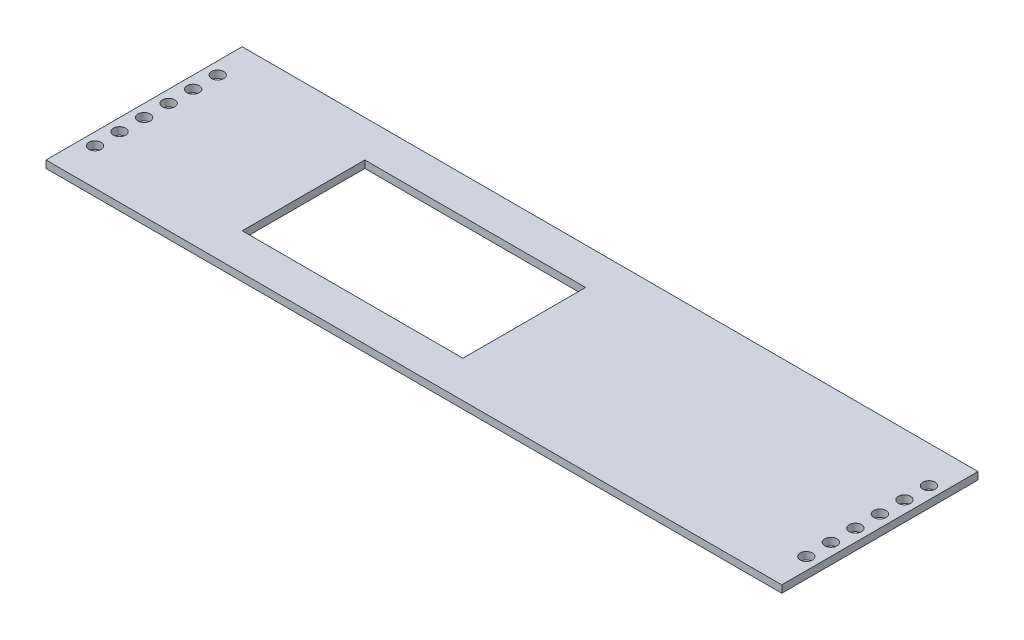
ISO-10303-21;
HEADER;
FILE_DESCRIPTION(('STEP AP214'),'2;1');
FILE_NAME('part.step','',(''),(''),'','','');
FILE_SCHEMA(('AUTOMOTIVE_DESIGN { 1 0 10303 214 1 1 1 1 }'));
ENDSEC;
DATA;
#1=APPLICATION_CONTEXT('core data for automotive mechanical design processes');
#2=APPLICATION_PROTOCOL_DEFINITION('international standard','automotive_design',2000,#1);
#3=PRODUCT_CONTEXT('',#1,'mechanical');
#4=PRODUCT('Part','Part','',(#3));
#5=PRODUCT_RELATED_PRODUCT_CATEGORY('part','',(#4));
#6=PRODUCT_DEFINITION_FORMATION('','',#4);
#7=PRODUCT_DEFINITION_CONTEXT('part definition',#1,'design');
#8=PRODUCT_DEFINITION('design','',#6,#7);
#9=PRODUCT_DEFINITION_SHAPE('','',#8);
#10=(LENGTH_UNIT() NAMED_UNIT(*) SI_UNIT(.MILLI.,.METRE.));
#11=(NAMED_UNIT(*) PLANE_ANGLE_UNIT() SI_UNIT($,.RADIAN.));
#12=(NAMED_UNIT(*) SI_UNIT($,.STERADIAN.) SOLID_ANGLE_UNIT());
#13=UNCERTAINTY_MEASURE_WITH_UNIT(LENGTH_MEASURE(1.E-05),#10,'distance_accuracy_value','');
#14=(GEOMETRIC_REPRESENTATION_CONTEXT(3) GLOBAL_UNCERTAINTY_ASSIGNED_CONTEXT((#13)) GLOBAL_UNIT_ASSIGNED_CONTEXT((#10,
#11,#12)) REPRESENTATION_CONTEXT('',''));
#15=CARTESIAN_POINT('',(0.,0.,0.));
#16=DIRECTION('',(0.,0.,1.));
#17=DIRECTION('',(1.,0.,0.));
#18=AXIS2_PLACEMENT_3D('',#15,#16,#17);
#19=CARTESIAN_POINT('',(300.,6.,80.));
#20=DIRECTION('',(-1.,0.,0.));
#21=DIRECTION('',(0.,0.,1.));
#22=AXIS2_PLACEMENT_3D('',#19,#20,#21);
#23=PLANE('',#22);
#24=DIRECTION('',(0.,0.,-1.));
#25=VECTOR('',#24,1.);
#26=CARTESIAN_POINT('',(300.,0.,80.));
#27=LINE('',#26,#25);
#28=CARTESIAN_POINT('',(300.,0.,80.));
#29=VERTEX_POINT('',#28);
#30=CARTESIAN_POINT('',(300.,0.,-80.));
#31=VERTEX_POINT('',#30);
#32=EDGE_CURVE('E194',#29,#31,#27,.T.);
#33=ORIENTED_EDGE('',*,*,#32,.T.);
#34=DIRECTION('',(0.,-1.,0.));
#35=VECTOR('',#34,1.);
#36=CARTESIAN_POINT('',(300.,6.,-80.));
#37=LINE('',#36,#35);
#38=CARTESIAN_POINT('',(300.,6.,-80.));
#39=VERTEX_POINT('',#38);
#40=EDGE_CURVE('E223',#39,#31,#37,.T.);
#41=ORIENTED_EDGE('',*,*,#40,.F.);
#42=DIRECTION('',(0.,0.,-1.));
#43=VECTOR('',#42,1.);
#44=CARTESIAN_POINT('',(300.,6.,80.));
#45=LINE('',#44,#43);
#46=CARTESIAN_POINT('',(300.,6.,80.));
#47=VERTEX_POINT('',#46);
#48=EDGE_CURVE('E197',#47,#39,#45,.T.);
#49=ORIENTED_EDGE('',*,*,#48,.F.);
#50=DIRECTION('',(0.,-1.,0.));
#51=VECTOR('',#50,1.);
#52=CARTESIAN_POINT('',(300.,6.,80.));
#53=LINE('',#52,#51);
#54=EDGE_CURVE('E207',#47,#29,#53,.T.);
#55=ORIENTED_EDGE('',*,*,#54,.T.);
#56=EDGE_LOOP('',(#33,#41,#49,#55));
#57=FACE_BOUND('',#56,.T.);
#58=ADVANCED_FACE('F33',(#57),#23,.F.);
#59=CARTESIAN_POINT('',(-300.,6.,-80.));
#60=DIRECTION('',(0.,0.,1.));
#61=DIRECTION('',(1.,0.,0.));
#62=AXIS2_PLACEMENT_3D('',#59,#60,#61);
#63=PLANE('',#62);
#64=DIRECTION('',(-1.,0.,0.));
#65=VECTOR('',#64,1.);
#66=CARTESIAN_POINT('',(-300.,0.,-80.));
#67=LINE('',#66,#65);
#68=CARTESIAN_POINT('',(-300.,0.,-80.));
#69=VERTEX_POINT('',#68);
#70=EDGE_CURVE('E210',#31,#69,#67,.T.);
#71=ORIENTED_EDGE('',*,*,#70,.T.);
#72=DIRECTION('',(0.,-1.,0.));
#73=VECTOR('',#72,1.);
#74=CARTESIAN_POINT('',(-300.,6.,-80.));
#75=LINE('',#74,#73);
#76=CARTESIAN_POINT('',(-300.,6.,-80.));
#77=VERTEX_POINT('',#76);
#78=EDGE_CURVE('E220',#77,#69,#75,.T.);
#79=ORIENTED_EDGE('',*,*,#78,.F.);
#80=DIRECTION('',(-1.,0.,0.));
#81=VECTOR('',#80,1.);
#82=CARTESIAN_POINT('',(-300.,6.,-80.));
#83=LINE('',#82,#81);
#84=EDGE_CURVE('E200',#39,#77,#83,.T.);
#85=ORIENTED_EDGE('',*,*,#84,.F.);
#86=ORIENTED_EDGE('',*,*,#40,.T.);
#87=EDGE_LOOP('',(#71,#79,#85,#86));
#88=FACE_BOUND('',#87,.T.);
#89=ADVANCED_FACE('F250',(#88),#63,.F.);
#90=CARTESIAN_POINT('',(-300.,6.,80.));
#91=DIRECTION('',(1.,0.,0.));
#92=DIRECTION('',(0.,0.,-1.));
#93=AXIS2_PLACEMENT_3D('',#90,#91,#92);
#94=PLANE('',#93);
#95=DIRECTION('',(0.,0.,1.));
#96=VECTOR('',#95,1.);
#97=CARTESIAN_POINT('',(-300.,0.,80.));
#98=LINE('',#97,#96);
#99=CARTESIAN_POINT('',(-300.,0.,80.));
#100=VERTEX_POINT('',#99);
#101=EDGE_CURVE('E212',#69,#100,#98,.T.);
#102=ORIENTED_EDGE('',*,*,#101,.T.);
#103=DIRECTION('',(0.,-1.,0.));
#104=VECTOR('',#103,1.);
#105=CARTESIAN_POINT('',(-300.,6.,80.));
#106=LINE('',#105,#104);
#107=CARTESIAN_POINT('',(-300.,6.,80.));
#108=VERTEX_POINT('',#107);
#109=EDGE_CURVE('E217',#108,#100,#106,.T.);
#110=ORIENTED_EDGE('',*,*,#109,.F.);
#111=DIRECTION('',(0.,0.,1.));
#112=VECTOR('',#111,1.);
#113=CARTESIAN_POINT('',(-300.,6.,80.));
#114=LINE('',#113,#112);
#115=EDGE_CURVE('E203',#77,#108,#114,.T.);
#116=ORIENTED_EDGE('',*,*,#115,.F.);
#117=ORIENTED_EDGE('',*,*,#78,.T.);
#118=EDGE_LOOP('',(#102,#110,#116,#117));
#119=FACE_BOUND('',#118,.T.);
#120=ADVANCED_FACE('F255',(#119),#94,.F.);
#121=CARTESIAN_POINT('',(-300.,6.,80.));
#122=DIRECTION('',(0.,0.,-1.));
#123=DIRECTION('',(-1.,0.,0.));
#124=AXIS2_PLACEMENT_3D('',#121,#122,#123);
#125=PLANE('',#124);
#126=DIRECTION('',(1.,0.,0.));
#127=VECTOR('',#126,1.);
#128=CARTESIAN_POINT('',(-300.,0.,80.));
#129=LINE('',#128,#127);
#130=EDGE_CURVE('E201',#100,#29,#129,.T.);
#131=ORIENTED_EDGE('',*,*,#130,.T.);
#132=ORIENTED_EDGE('',*,*,#54,.F.);
#133=DIRECTION('',(1.,0.,0.));
#134=VECTOR('',#133,1.);
#135=CARTESIAN_POINT('',(-300.,6.,80.));
#136=LINE('',#135,#134);
#137=EDGE_CURVE('E205',#108,#47,#136,.T.);
#138=ORIENTED_EDGE('',*,*,#137,.F.);
#139=ORIENTED_EDGE('',*,*,#109,.T.);
#140=EDGE_LOOP('',(#131,#132,#138,#139));
#141=FACE_BOUND('',#140,.T.);
#142=ADVANCED_FACE('F270',(#141),#125,.F.);
#143=CARTESIAN_POINT('',(0.,6.,0.));
#144=DIRECTION('',(0.,-1.,0.));
#145=DIRECTION('',(0.,0.,-1.));
#146=AXIS2_PLACEMENT_3D('',#143,#144,#145);
#147=PLANE('',#146);
#148=DIRECTION('',(-1.,0.,0.));
#149=VECTOR('',#148,1.);
#150=CARTESIAN_POINT('',(-170.,6.,-50.));
#151=LINE('',#150,#149);
#152=CARTESIAN_POINT('',(9.99999999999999,6.,-50.));
#153=VERTEX_POINT('',#152);
#154=CARTESIAN_POINT('',(-170.,6.,-50.));
#155=VERTEX_POINT('',#154);
#156=EDGE_CURVE('E108',#153,#155,#151,.T.);
#157=ORIENTED_EDGE('',*,*,#156,.F.);
#158=DIRECTION('',(0.,0.,-1.));
#159=VECTOR('',#158,1.);
#160=CARTESIAN_POINT('',(9.99999999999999,6.,50.));
#161=LINE('',#160,#159);
#162=CARTESIAN_POINT('',(9.99999999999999,6.,50.));
#163=VERTEX_POINT('',#162);
#164=EDGE_CURVE('E47',#163,#153,#161,.T.);
#165=ORIENTED_EDGE('',*,*,#164,.F.);
#166=DIRECTION('',(1.,0.,0.));
#167=VECTOR('',#166,1.);
#168=CARTESIAN_POINT('',(-170.,6.,50.));
#169=LINE('',#168,#167);
#170=CARTESIAN_POINT('',(-170.,6.,50.));
#171=VERTEX_POINT('',#170);
#172=EDGE_CURVE('E115',#171,#163,#169,.T.);
#173=ORIENTED_EDGE('',*,*,#172,.F.);
#174=DIRECTION('',(0.,0.,1.));
#175=VECTOR('',#174,1.);
#176=CARTESIAN_POINT('',(-170.,6.,50.));
#177=LINE('',#176,#175);
#178=EDGE_CURVE('E99',#155,#171,#177,.T.);
#179=ORIENTED_EDGE('',*,*,#178,.F.);
#180=EDGE_LOOP('',(#157,#165,#173,#179));
#181=FACE_BOUND('',#180,.T.);
#182=CARTESIAN_POINT('',(290.,6.,30.));
#183=DIRECTION('',(0.,-1.,0.));
#184=DIRECTION('',(0.,0.,1.));
#185=AXIS2_PLACEMENT_3D('',#182,#183,#184);
#186=CIRCLE('',#185,4.99999999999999);
#187=CARTESIAN_POINT('',(290.,6.,35.));
#188=VERTEX_POINT('',#187);
#189=EDGE_CURVE('E129',#188,#188,#186,.T.);
#190=ORIENTED_EDGE('',*,*,#189,.T.);
#191=EDGE_LOOP('',(#190));
#192=FACE_BOUND('',#191,.T.);
#193=CARTESIAN_POINT('',(290.,6.,10.));
#194=DIRECTION('',(0.,-1.,0.));
#195=DIRECTION('',(0.,0.,1.));
#196=AXIS2_PLACEMENT_3D('',#193,#194,#195);
#197=CIRCLE('',#196,4.99999999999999);
#198=CARTESIAN_POINT('',(290.,6.,15.));
#199=VERTEX_POINT('',#198);
#200=EDGE_CURVE('E135',#199,#199,#197,.T.);
#201=ORIENTED_EDGE('',*,*,#200,.T.);
#202=EDGE_LOOP('',(#201));
#203=FACE_BOUND('',#202,.T.);
#204=CARTESIAN_POINT('',(290.,6.,-9.99999999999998));
#205=DIRECTION('',(0.,-1.,0.));
#206=DIRECTION('',(0.,0.,1.));
#207=AXIS2_PLACEMENT_3D('',#204,#205,#206);
#208=CIRCLE('',#207,4.99999999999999);
#209=CARTESIAN_POINT('',(290.,6.,-4.99999999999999));
#210=VERTEX_POINT('',#209);
#211=EDGE_CURVE('E122',#210,#210,#208,.T.);
#212=ORIENTED_EDGE('',*,*,#211,.T.);
#213=EDGE_LOOP('',(#212));
#214=FACE_BOUND('',#213,.T.);
#215=CARTESIAN_POINT('',(290.,6.,-50.));
#216=DIRECTION('',(0.,-1.,0.));
#217=DIRECTION('',(0.,0.,1.));
#218=AXIS2_PLACEMENT_3D('',#215,#216,#217);
#219=CIRCLE('',#218,4.99999999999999);
#220=CARTESIAN_POINT('',(290.,6.,-45.));
#221=VERTEX_POINT('',#220);
#222=EDGE_CURVE('E143',#221,#221,#219,.T.);
#223=ORIENTED_EDGE('',*,*,#222,.T.);
#224=EDGE_LOOP('',(#223));
#225=FACE_BOUND('',#224,.T.);
#226=CARTESIAN_POINT('',(290.,6.,-30.));
#227=DIRECTION('',(0.,-1.,0.));
#228=DIRECTION('',(0.,0.,1.));
#229=AXIS2_PLACEMENT_3D('',#226,#227,#228);
#230=CIRCLE('',#229,4.99999999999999);
#231=CARTESIAN_POINT('',(290.,6.,-25.));
#232=VERTEX_POINT('',#231);
#233=EDGE_CURVE('E142',#232,#232,#230,.T.);
#234=ORIENTED_EDGE('',*,*,#233,.T.);
#235=EDGE_LOOP('',(#234));
#236=FACE_BOUND('',#235,.T.);
#237=CARTESIAN_POINT('',(290.,6.,50.));
#238=DIRECTION('',(0.,-1.,0.));
#239=DIRECTION('',(0.,0.,1.));
#240=AXIS2_PLACEMENT_3D('',#237,#238,#239);
#241=CIRCLE('',#240,4.99999999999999);
#242=CARTESIAN_POINT('',(290.,6.,55.));
#243=VERTEX_POINT('',#242);
#244=EDGE_CURVE('E128',#243,#243,#241,.T.);
#245=ORIENTED_EDGE('',*,*,#244,.T.);
#246=EDGE_LOOP('',(#245));
#247=FACE_BOUND('',#246,.T.);
#248=CARTESIAN_POINT('',(-290.,6.,30.));
#249=DIRECTION('',(0.,1.,0.));
#250=DIRECTION('',(0.,0.,1.));
#251=AXIS2_PLACEMENT_3D('',#248,#249,#250);
#252=CIRCLE('',#251,4.99999999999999);
#253=CARTESIAN_POINT('',(-290.,6.,35.));
#254=VERTEX_POINT('',#253);
#255=EDGE_CURVE('E165',#254,#254,#252,.T.);
#256=ORIENTED_EDGE('',*,*,#255,.F.);
#257=EDGE_LOOP('',(#256));
#258=FACE_BOUND('',#257,.T.);
#259=CARTESIAN_POINT('',(-290.,6.,10.));
#260=DIRECTION('',(0.,1.,0.));
#261=DIRECTION('',(0.,0.,1.));
#262=AXIS2_PLACEMENT_3D('',#259,#260,#261);
#263=CIRCLE('',#262,4.99999999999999);
#264=CARTESIAN_POINT('',(-290.,6.,15.));
#265=VERTEX_POINT('',#264);
#266=EDGE_CURVE('E171',#265,#265,#263,.T.);
#267=ORIENTED_EDGE('',*,*,#266,.F.);
#268=EDGE_LOOP('',(#267));
#269=FACE_BOUND('',#268,.T.);
#270=CARTESIAN_POINT('',(-290.,6.,-9.99999999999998));
#271=DIRECTION('',(0.,1.,0.));
#272=DIRECTION('',(0.,0.,1.));
#273=AXIS2_PLACEMENT_3D('',#270,#271,#272);
#274=CIRCLE('',#273,4.99999999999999);
#275=CARTESIAN_POINT('',(-290.,6.,-4.99999999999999));
#276=VERTEX_POINT('',#275);
#277=EDGE_CURVE('E158',#276,#276,#274,.T.);
#278=ORIENTED_EDGE('',*,*,#277,.F.);
#279=EDGE_LOOP('',(#278));
#280=FACE_BOUND('',#279,.T.);
#281=CARTESIAN_POINT('',(-290.,6.,-50.));
#282=DIRECTION('',(0.,1.,0.));
#283=DIRECTION('',(0.,0.,1.));
#284=AXIS2_PLACEMENT_3D('',#281,#282,#283);
#285=CIRCLE('',#284,4.99999999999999);
#286=CARTESIAN_POINT('',(-290.,6.,-45.));
#287=VERTEX_POINT('',#286);
#288=EDGE_CURVE('E179',#287,#287,#285,.T.);
#289=ORIENTED_EDGE('',*,*,#288,.F.);
#290=EDGE_LOOP('',(#289));
#291=FACE_BOUND('',#290,.T.);
#292=CARTESIAN_POINT('',(-290.,6.,-30.));
#293=DIRECTION('',(0.,1.,0.));
#294=DIRECTION('',(0.,0.,1.));
#295=AXIS2_PLACEMENT_3D('',#292,#293,#294);
#296=CIRCLE('',#295,4.99999999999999);
#297=CARTESIAN_POINT('',(-290.,6.,-25.));
#298=VERTEX_POINT('',#297);
#299=EDGE_CURVE('E178',#298,#298,#296,.T.);
#300=ORIENTED_EDGE('',*,*,#299,.F.);
#301=EDGE_LOOP('',(#300));
#302=FACE_BOUND('',#301,.T.);
#303=CARTESIAN_POINT('',(-290.,6.,50.));
#304=DIRECTION('',(0.,1.,0.));
#305=DIRECTION('',(0.,0.,1.));
#306=AXIS2_PLACEMENT_3D('',#303,#304,#305);
#307=CIRCLE('',#306,4.99999999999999);
#308=CARTESIAN_POINT('',(-290.,6.,55.));
#309=VERTEX_POINT('',#308);
#310=EDGE_CURVE('E164',#309,#309,#307,.T.);
#311=ORIENTED_EDGE('',*,*,#310,.F.);
#312=EDGE_LOOP('',(#311));
#313=FACE_BOUND('',#312,.T.);
#314=ORIENTED_EDGE('',*,*,#48,.T.);
#315=ORIENTED_EDGE('',*,*,#84,.T.);
#316=ORIENTED_EDGE('',*,*,#115,.T.);
#317=ORIENTED_EDGE('',*,*,#137,.T.);
#318=EDGE_LOOP('',(#314,#315,#316,#317));
#319=FACE_BOUND('',#318,.T.);
#320=ADVANCED_FACE('F112',(#181,#192,#203,#214,#225,#236,#247,#258,#269,#280,#291,#302,#313,
#319),#147,.F.);
#321=CARTESIAN_POINT('',(0.,0.,0.));
#322=DIRECTION('',(0.,-1.,0.));
#323=DIRECTION('',(0.,0.,-1.));
#324=AXIS2_PLACEMENT_3D('',#321,#322,#323);
#325=PLANE('',#324);
#326=DIRECTION('',(0.,0.,1.));
#327=VECTOR('',#326,1.);
#328=CARTESIAN_POINT('',(9.99999999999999,0.,0.));
#329=LINE('',#328,#327);
#330=CARTESIAN_POINT('',(9.99999999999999,0.,-50.));
#331=VERTEX_POINT('',#330);
#332=CARTESIAN_POINT('',(9.99999999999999,0.,50.));
#333=VERTEX_POINT('',#332);
#334=EDGE_CURVE('E11',#331,#333,#329,.T.);
#335=ORIENTED_EDGE('',*,*,#334,.F.);
#336=DIRECTION('',(1.,0.,0.));
#337=VECTOR('',#336,1.);
#338=CARTESIAN_POINT('',(0.,0.,-50.));
#339=LINE('',#338,#337);
#340=CARTESIAN_POINT('',(-170.,0.,-50.));
#341=VERTEX_POINT('',#340);
#342=EDGE_CURVE('E226',#341,#331,#339,.T.);
#343=ORIENTED_EDGE('',*,*,#342,.F.);
#344=DIRECTION('',(0.,0.,-1.));
#345=VECTOR('',#344,1.);
#346=CARTESIAN_POINT('',(-170.,0.,0.));
#347=LINE('',#346,#345);
#348=CARTESIAN_POINT('',(-170.,0.,50.));
#349=VERTEX_POINT('',#348);
#350=EDGE_CURVE('E102',#349,#341,#347,.T.);
#351=ORIENTED_EDGE('',*,*,#350,.F.);
#352=DIRECTION('',(-1.,0.,0.));
#353=VECTOR('',#352,1.);
#354=CARTESIAN_POINT('',(0.,0.,50.));
#355=LINE('',#354,#353);
#356=EDGE_CURVE('E40',#333,#349,#355,.T.);
#357=ORIENTED_EDGE('',*,*,#356,.F.);
#358=EDGE_LOOP('',(#335,#343,#351,#357));
#359=FACE_BOUND('',#358,.T.);
#360=CARTESIAN_POINT('',(290.,0.,30.));
#361=DIRECTION('',(0.,-1.,0.));
#362=DIRECTION('',(0.,0.,1.));
#363=AXIS2_PLACEMENT_3D('',#360,#361,#362);
#364=CIRCLE('',#363,4.99999999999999);
#365=CARTESIAN_POINT('',(290.,0.,35.));
#366=VERTEX_POINT('',#365);
#367=EDGE_CURVE('E125',#366,#366,#364,.T.);
#368=ORIENTED_EDGE('',*,*,#367,.F.);
#369=EDGE_LOOP('',(#368));
#370=FACE_BOUND('',#369,.T.);
#371=CARTESIAN_POINT('',(290.,0.,10.));
#372=DIRECTION('',(0.,-1.,0.));
#373=DIRECTION('',(0.,0.,1.));
#374=AXIS2_PLACEMENT_3D('',#371,#372,#373);
#375=CIRCLE('',#374,4.99999999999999);
#376=CARTESIAN_POINT('',(290.,0.,15.));
#377=VERTEX_POINT('',#376);
#378=EDGE_CURVE('E132',#377,#377,#375,.T.);
#379=ORIENTED_EDGE('',*,*,#378,.F.);
#380=EDGE_LOOP('',(#379));
#381=FACE_BOUND('',#380,.T.);
#382=CARTESIAN_POINT('',(290.,0.,-9.99999999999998));
#383=DIRECTION('',(0.,-1.,0.));
#384=DIRECTION('',(0.,0.,1.));
#385=AXIS2_PLACEMENT_3D('',#382,#383,#384);
#386=CIRCLE('',#385,4.99999999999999);
#387=CARTESIAN_POINT('',(290.,0.,-4.99999999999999));
#388=VERTEX_POINT('',#387);
#389=EDGE_CURVE('E146',#388,#388,#386,.T.);
#390=ORIENTED_EDGE('',*,*,#389,.F.);
#391=EDGE_LOOP('',(#390));
#392=FACE_BOUND('',#391,.T.);
#393=CARTESIAN_POINT('',(290.,0.,-50.));
#394=DIRECTION('',(0.,-1.,0.));
#395=DIRECTION('',(0.,0.,1.));
#396=AXIS2_PLACEMENT_3D('',#393,#394,#395);
#397=CIRCLE('',#396,4.99999999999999);
#398=CARTESIAN_POINT('',(290.,0.,-45.));
#399=VERTEX_POINT('',#398);
#400=EDGE_CURVE('E139',#399,#399,#397,.T.);
#401=ORIENTED_EDGE('',*,*,#400,.F.);
#402=EDGE_LOOP('',(#401));
#403=FACE_BOUND('',#402,.T.);
#404=CARTESIAN_POINT('',(290.,0.,-30.));
#405=DIRECTION('',(0.,-1.,0.));
#406=DIRECTION('',(0.,0.,1.));
#407=AXIS2_PLACEMENT_3D('',#404,#405,#406);
#408=CIRCLE('',#407,4.99999999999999);
#409=CARTESIAN_POINT('',(290.,0.,-25.));
#410=VERTEX_POINT('',#409);
#411=EDGE_CURVE('E138',#410,#410,#408,.T.);
#412=ORIENTED_EDGE('',*,*,#411,.F.);
#413=EDGE_LOOP('',(#412));
#414=FACE_BOUND('',#413,.T.);
#415=CARTESIAN_POINT('',(290.,0.,50.));
#416=DIRECTION('',(0.,-1.,0.));
#417=DIRECTION('',(0.,0.,1.));
#418=AXIS2_PLACEMENT_3D('',#415,#416,#417);
#419=CIRCLE('',#418,4.99999999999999);
#420=CARTESIAN_POINT('',(290.,0.,55.));
#421=VERTEX_POINT('',#420);
#422=EDGE_CURVE('E155',#421,#421,#419,.T.);
#423=ORIENTED_EDGE('',*,*,#422,.F.);
#424=EDGE_LOOP('',(#423));
#425=FACE_BOUND('',#424,.T.);
#426=CARTESIAN_POINT('',(-290.,0.,30.));
#427=DIRECTION('',(0.,1.,0.));
#428=DIRECTION('',(0.,0.,1.));
#429=AXIS2_PLACEMENT_3D('',#426,#427,#428);
#430=CIRCLE('',#429,4.99999999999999);
#431=CARTESIAN_POINT('',(-290.,0.,35.));
#432=VERTEX_POINT('',#431);
#433=EDGE_CURVE('E161',#432,#432,#430,.T.);
#434=ORIENTED_EDGE('',*,*,#433,.T.);
#435=EDGE_LOOP('',(#434));
#436=FACE_BOUND('',#435,.T.);
#437=CARTESIAN_POINT('',(-290.,0.,10.));
#438=DIRECTION('',(0.,1.,0.));
#439=DIRECTION('',(0.,0.,1.));
#440=AXIS2_PLACEMENT_3D('',#437,#438,#439);
#441=CIRCLE('',#440,4.99999999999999);
#442=CARTESIAN_POINT('',(-290.,0.,15.));
#443=VERTEX_POINT('',#442);
#444=EDGE_CURVE('E168',#443,#443,#441,.T.);
#445=ORIENTED_EDGE('',*,*,#444,.T.);
#446=EDGE_LOOP('',(#445));
#447=FACE_BOUND('',#446,.T.);
#448=CARTESIAN_POINT('',(-290.,0.,-9.99999999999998));
#449=DIRECTION('',(0.,1.,0.));
#450=DIRECTION('',(0.,0.,1.));
#451=AXIS2_PLACEMENT_3D('',#448,#449,#450);
#452=CIRCLE('',#451,4.99999999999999);
#453=CARTESIAN_POINT('',(-290.,0.,-4.99999999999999));
#454=VERTEX_POINT('',#453);
#455=EDGE_CURVE('E182',#454,#454,#452,.T.);
#456=ORIENTED_EDGE('',*,*,#455,.T.);
#457=EDGE_LOOP('',(#456));
#458=FACE_BOUND('',#457,.T.);
#459=CARTESIAN_POINT('',(-290.,0.,-50.));
#460=DIRECTION('',(0.,1.,0.));
#461=DIRECTION('',(0.,0.,1.));
#462=AXIS2_PLACEMENT_3D('',#459,#460,#461);
#463=CIRCLE('',#462,4.99999999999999);
#464=CARTESIAN_POINT('',(-290.,0.,-45.));
#465=VERTEX_POINT('',#464);
#466=EDGE_CURVE('E175',#465,#465,#463,.T.);
#467=ORIENTED_EDGE('',*,*,#466,.T.);
#468=EDGE_LOOP('',(#467));
#469=FACE_BOUND('',#468,.T.);
#470=CARTESIAN_POINT('',(-290.,0.,-30.));
#471=DIRECTION('',(0.,1.,0.));
#472=DIRECTION('',(0.,0.,1.));
#473=AXIS2_PLACEMENT_3D('',#470,#471,#472);
#474=CIRCLE('',#473,4.99999999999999);
#475=CARTESIAN_POINT('',(-290.,0.,-25.));
#476=VERTEX_POINT('',#475);
#477=EDGE_CURVE('E174',#476,#476,#474,.T.);
#478=ORIENTED_EDGE('',*,*,#477,.T.);
#479=EDGE_LOOP('',(#478));
#480=FACE_BOUND('',#479,.T.);
#481=CARTESIAN_POINT('',(-290.,0.,50.));
#482=DIRECTION('',(0.,1.,0.));
#483=DIRECTION('',(0.,0.,1.));
#484=AXIS2_PLACEMENT_3D('',#481,#482,#483);
#485=CIRCLE('',#484,4.99999999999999);
#486=CARTESIAN_POINT('',(-290.,0.,55.));
#487=VERTEX_POINT('',#486);
#488=EDGE_CURVE('E191',#487,#487,#485,.T.);
#489=ORIENTED_EDGE('',*,*,#488,.T.);
#490=EDGE_LOOP('',(#489));
#491=FACE_BOUND('',#490,.T.);
#492=ORIENTED_EDGE('',*,*,#32,.F.);
#493=ORIENTED_EDGE('',*,*,#130,.F.);
#494=ORIENTED_EDGE('',*,*,#101,.F.);
#495=ORIENTED_EDGE('',*,*,#70,.F.);
#496=EDGE_LOOP('',(#492,#493,#494,#495));
#497=FACE_BOUND('',#496,.T.);
#498=ADVANCED_FACE('F234',(#359,#370,#381,#392,#403,#414,#425,#436,#447,#458,#469,#480,#491,
#497),#325,.T.);
#499=CARTESIAN_POINT('',(-290.,0.,50.));
#500=DIRECTION('',(0.,1.,0.));
#501=DIRECTION('',(0.,0.,1.));
#502=AXIS2_PLACEMENT_3D('',#499,#500,#501);
#503=CYLINDRICAL_SURFACE('',#502,4.99999999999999);
#504=ORIENTED_EDGE('',*,*,#488,.F.);
#505=EDGE_LOOP('',(#504));
#506=FACE_BOUND('',#505,.T.);
#507=ORIENTED_EDGE('',*,*,#310,.T.);
#508=EDGE_LOOP('',(#507));
#509=FACE_BOUND('',#508,.T.);
#510=ADVANCED_FACE('F281',(#506,#509),#503,.F.);
#511=CARTESIAN_POINT('',(-290.,0.,-30.));
#512=DIRECTION('',(0.,1.,0.));
#513=DIRECTION('',(0.,0.,1.));
#514=AXIS2_PLACEMENT_3D('',#511,#512,#513);
#515=CYLINDRICAL_SURFACE('',#514,4.99999999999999);
#516=ORIENTED_EDGE('',*,*,#477,.F.);
#517=EDGE_LOOP('',(#516));
#518=FACE_BOUND('',#517,.T.);
#519=ORIENTED_EDGE('',*,*,#299,.T.);
#520=EDGE_LOOP('',(#519));
#521=FACE_BOUND('',#520,.T.);
#522=ADVANCED_FACE('F286',(#518,#521),#515,.F.);
#523=CARTESIAN_POINT('',(-290.,0.,-50.));
#524=DIRECTION('',(0.,1.,0.));
#525=DIRECTION('',(0.,0.,1.));
#526=AXIS2_PLACEMENT_3D('',#523,#524,#525);
#527=CYLINDRICAL_SURFACE('',#526,4.99999999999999);
#528=ORIENTED_EDGE('',*,*,#466,.F.);
#529=EDGE_LOOP('',(#528));
#530=FACE_BOUND('',#529,.T.);
#531=ORIENTED_EDGE('',*,*,#288,.T.);
#532=EDGE_LOOP('',(#531));
#533=FACE_BOUND('',#532,.T.);
#534=ADVANCED_FACE('F290',(#530,#533),#527,.F.);
#535=CARTESIAN_POINT('',(-290.,0.,-9.99999999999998));
#536=DIRECTION('',(0.,1.,0.));
#537=DIRECTION('',(0.,0.,1.));
#538=AXIS2_PLACEMENT_3D('',#535,#536,#537);
#539=CYLINDRICAL_SURFACE('',#538,4.99999999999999);
#540=ORIENTED_EDGE('',*,*,#455,.F.);
#541=EDGE_LOOP('',(#540));
#542=FACE_BOUND('',#541,.T.);
#543=ORIENTED_EDGE('',*,*,#277,.T.);
#544=EDGE_LOOP('',(#543));
#545=FACE_BOUND('',#544,.T.);
#546=ADVANCED_FACE('F292',(#542,#545),#539,.F.);
#547=CARTESIAN_POINT('',(-290.,0.,10.));
#548=DIRECTION('',(0.,1.,0.));
#549=DIRECTION('',(0.,0.,1.));
#550=AXIS2_PLACEMENT_3D('',#547,#548,#549);
#551=CYLINDRICAL_SURFACE('',#550,4.99999999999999);
#552=ORIENTED_EDGE('',*,*,#444,.F.);
#553=EDGE_LOOP('',(#552));
#554=FACE_BOUND('',#553,.T.);
#555=ORIENTED_EDGE('',*,*,#266,.T.);
#556=EDGE_LOOP('',(#555));
#557=FACE_BOUND('',#556,.T.);
#558=ADVANCED_FACE('F295',(#554,#557),#551,.F.);
#559=CARTESIAN_POINT('',(-290.,0.,30.));
#560=DIRECTION('',(0.,1.,0.));
#561=DIRECTION('',(0.,0.,1.));
#562=AXIS2_PLACEMENT_3D('',#559,#560,#561);
#563=CYLINDRICAL_SURFACE('',#562,4.99999999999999);
#564=ORIENTED_EDGE('',*,*,#433,.F.);
#565=EDGE_LOOP('',(#564));
#566=FACE_BOUND('',#565,.T.);
#567=ORIENTED_EDGE('',*,*,#255,.T.);
#568=EDGE_LOOP('',(#567));
#569=FACE_BOUND('',#568,.T.);
#570=ADVANCED_FACE('F302',(#566,#569),#563,.F.);
#571=CARTESIAN_POINT('',(290.,0.,50.));
#572=DIRECTION('',(0.,1.,0.));
#573=DIRECTION('',(0.,0.,1.));
#574=AXIS2_PLACEMENT_3D('',#571,#572,#573);
#575=CYLINDRICAL_SURFACE('',#574,4.99999999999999);
#576=ORIENTED_EDGE('',*,*,#422,.T.);
#577=EDGE_LOOP('',(#576));
#578=FACE_BOUND('',#577,.T.);
#579=ORIENTED_EDGE('',*,*,#244,.F.);
#580=EDGE_LOOP('',(#579));
#581=FACE_BOUND('',#580,.T.);
#582=ADVANCED_FACE('F306',(#578,#581),#575,.F.);
#583=CARTESIAN_POINT('',(290.,0.,-30.));
#584=DIRECTION('',(0.,1.,0.));
#585=DIRECTION('',(0.,0.,1.));
#586=AXIS2_PLACEMENT_3D('',#583,#584,#585);
#587=CYLINDRICAL_SURFACE('',#586,4.99999999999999);
#588=ORIENTED_EDGE('',*,*,#411,.T.);
#589=EDGE_LOOP('',(#588));
#590=FACE_BOUND('',#589,.T.);
#591=ORIENTED_EDGE('',*,*,#233,.F.);
#592=EDGE_LOOP('',(#591));
#593=FACE_BOUND('',#592,.T.);
#594=ADVANCED_FACE('F310',(#590,#593),#587,.F.);
#595=CARTESIAN_POINT('',(290.,0.,-50.));
#596=DIRECTION('',(0.,1.,0.));
#597=DIRECTION('',(0.,0.,1.));
#598=AXIS2_PLACEMENT_3D('',#595,#596,#597);
#599=CYLINDRICAL_SURFACE('',#598,4.99999999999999);
#600=ORIENTED_EDGE('',*,*,#400,.T.);
#601=EDGE_LOOP('',(#600));
#602=FACE_BOUND('',#601,.T.);
#603=ORIENTED_EDGE('',*,*,#222,.F.);
#604=EDGE_LOOP('',(#603));
#605=FACE_BOUND('',#604,.T.);
#606=ADVANCED_FACE('F314',(#602,#605),#599,.F.);
#607=CARTESIAN_POINT('',(290.,0.,-9.99999999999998));
#608=DIRECTION('',(0.,1.,0.));
#609=DIRECTION('',(0.,0.,1.));
#610=AXIS2_PLACEMENT_3D('',#607,#608,#609);
#611=CYLINDRICAL_SURFACE('',#610,4.99999999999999);
#612=ORIENTED_EDGE('',*,*,#389,.T.);
#613=EDGE_LOOP('',(#612));
#614=FACE_BOUND('',#613,.T.);
#615=ORIENTED_EDGE('',*,*,#211,.F.);
#616=EDGE_LOOP('',(#615));
#617=FACE_BOUND('',#616,.T.);
#618=ADVANCED_FACE('F316',(#614,#617),#611,.F.);
#619=CARTESIAN_POINT('',(290.,0.,10.));
#620=DIRECTION('',(0.,1.,0.));
#621=DIRECTION('',(0.,0.,1.));
#622=AXIS2_PLACEMENT_3D('',#619,#620,#621);
#623=CYLINDRICAL_SURFACE('',#622,4.99999999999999);
#624=ORIENTED_EDGE('',*,*,#378,.T.);
#625=EDGE_LOOP('',(#624));
#626=FACE_BOUND('',#625,.T.);
#627=ORIENTED_EDGE('',*,*,#200,.F.);
#628=EDGE_LOOP('',(#627));
#629=FACE_BOUND('',#628,.T.);
#630=ADVANCED_FACE('F245',(#626,#629),#623,.F.);
#631=CARTESIAN_POINT('',(290.,0.,30.));
#632=DIRECTION('',(0.,1.,0.));
#633=DIRECTION('',(0.,0.,1.));
#634=AXIS2_PLACEMENT_3D('',#631,#632,#633);
#635=CYLINDRICAL_SURFACE('',#634,4.99999999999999);
#636=ORIENTED_EDGE('',*,*,#367,.T.);
#637=EDGE_LOOP('',(#636));
#638=FACE_BOUND('',#637,.T.);
#639=ORIENTED_EDGE('',*,*,#189,.F.);
#640=EDGE_LOOP('',(#639));
#641=FACE_BOUND('',#640,.T.);
#642=ADVANCED_FACE('F238',(#638,#641),#635,.F.);
#643=CARTESIAN_POINT('',(9.99999999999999,-4.,50.));
#644=DIRECTION('',(1.,0.,0.));
#645=DIRECTION('',(0.,0.,-1.));
#646=AXIS2_PLACEMENT_3D('',#643,#644,#645);
#647=PLANE('',#646);
#648=ORIENTED_EDGE('',*,*,#334,.T.);
#649=DIRECTION('',(0.,1.,0.));
#650=VECTOR('',#649,1.);
#651=CARTESIAN_POINT('',(9.99999999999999,-4.,50.));
#652=LINE('',#651,#650);
#653=EDGE_CURVE('E120',#333,#163,#652,.T.);
#654=ORIENTED_EDGE('',*,*,#653,.T.);
#655=ORIENTED_EDGE('',*,*,#164,.T.);
#656=DIRECTION('',(0.,1.,0.));
#657=VECTOR('',#656,1.);
#658=CARTESIAN_POINT('',(9.99999999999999,-4.,-50.));
#659=LINE('',#658,#657);
#660=EDGE_CURVE('E105',#331,#153,#659,.T.);
#661=ORIENTED_EDGE('',*,*,#660,.F.);
#662=EDGE_LOOP('',(#648,#654,#655,#661));
#663=FACE_BOUND('',#662,.T.);
#664=ADVANCED_FACE('F236',(#663),#647,.F.);
#665=CARTESIAN_POINT('',(-170.,-4.,50.));
#666=DIRECTION('',(0.,0.,1.));
#667=DIRECTION('',(1.,0.,0.));
#668=AXIS2_PLACEMENT_3D('',#665,#666,#667);
#669=PLANE('',#668);
#670=ORIENTED_EDGE('',*,*,#356,.T.);
#671=DIRECTION('',(0.,1.,0.));
#672=VECTOR('',#671,1.);
#673=CARTESIAN_POINT('',(-170.,-4.,50.));
#674=LINE('',#673,#672);
#675=EDGE_CURVE('E104',#349,#171,#674,.T.);
#676=ORIENTED_EDGE('',*,*,#675,.T.);
#677=ORIENTED_EDGE('',*,*,#172,.T.);
#678=ORIENTED_EDGE('',*,*,#653,.F.);
#679=EDGE_LOOP('',(#670,#676,#677,#678));
#680=FACE_BOUND('',#679,.T.);
#681=ADVANCED_FACE('F231',(#680),#669,.F.);
#682=CARTESIAN_POINT('',(-170.,-4.,50.));
#683=DIRECTION('',(-1.,0.,0.));
#684=DIRECTION('',(0.,0.,1.));
#685=AXIS2_PLACEMENT_3D('',#682,#683,#684);
#686=PLANE('',#685);
#687=ORIENTED_EDGE('',*,*,#350,.T.);
#688=DIRECTION('',(0.,1.,0.));
#689=VECTOR('',#688,1.);
#690=CARTESIAN_POINT('',(-170.,-4.,-50.));
#691=LINE('',#690,#689);
#692=EDGE_CURVE('E55',#341,#155,#691,.T.);
#693=ORIENTED_EDGE('',*,*,#692,.T.);
#694=ORIENTED_EDGE('',*,*,#178,.T.);
#695=ORIENTED_EDGE('',*,*,#675,.F.);
#696=EDGE_LOOP('',(#687,#693,#694,#695));
#697=FACE_BOUND('',#696,.T.);
#698=ADVANCED_FACE('F96',(#697),#686,.F.);
#699=CARTESIAN_POINT('',(-170.,-4.,-50.));
#700=DIRECTION('',(0.,0.,-1.));
#701=DIRECTION('',(-1.,0.,0.));
#702=AXIS2_PLACEMENT_3D('',#699,#700,#701);
#703=PLANE('',#702);
#704=ORIENTED_EDGE('',*,*,#342,.T.);
#705=ORIENTED_EDGE('',*,*,#660,.T.);
#706=ORIENTED_EDGE('',*,*,#156,.T.);
#707=ORIENTED_EDGE('',*,*,#692,.F.);
#708=EDGE_LOOP('',(#704,#705,#706,#707));
#709=FACE_BOUND('',#708,.T.);
#710=ADVANCED_FACE('F109',(#709),#703,.F.);
#711=CLOSED_SHELL('',(#58,#89,#120,#142,#320,#498,#510,#522,#534,#546,#558,#570,#582,#594,#606,
#618,#630,#642,#664,#681,#698,#710));
#712=MANIFOLD_SOLID_BREP('B2',#711);
#713=ADVANCED_BREP_SHAPE_REPRESENTATION('',(#18,#712),#14);
#714=SHAPE_DEFINITION_REPRESENTATION(#9,#713);
ENDSEC;
END-ISO-10303-21;
